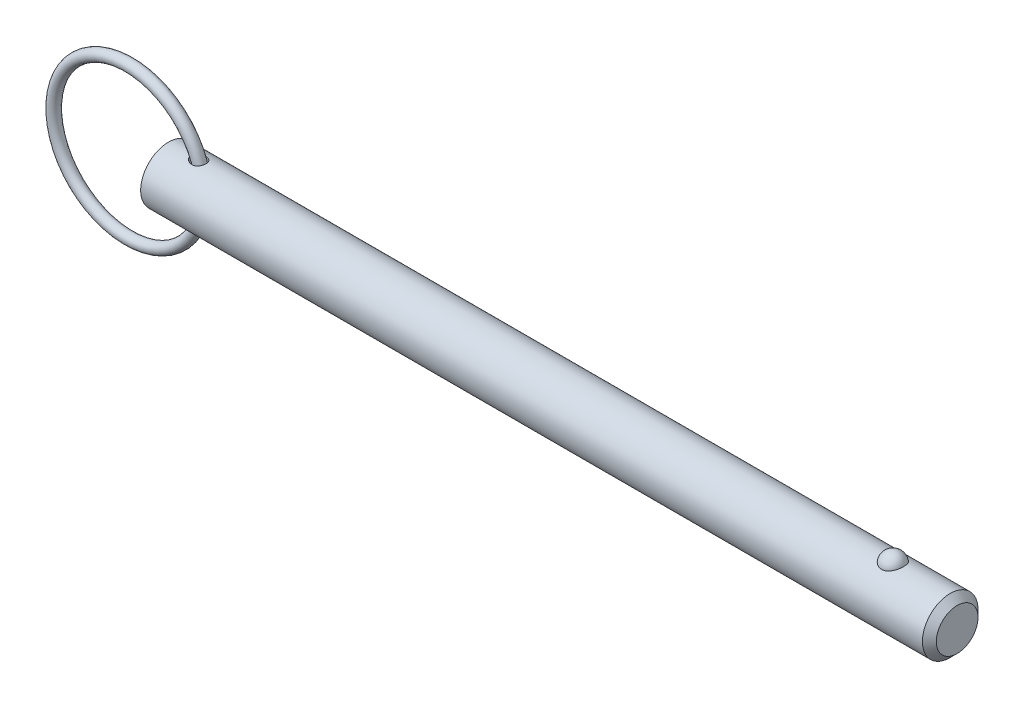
ISO-10303-21;
HEADER;
FILE_DESCRIPTION(('STEP AP214'),'2;1');
FILE_NAME('part.step','',(''),(''),'','','');
FILE_SCHEMA(('AUTOMOTIVE_DESIGN { 1 0 10303 214 1 1 1 1 }'));
ENDSEC;
DATA;
#1=APPLICATION_CONTEXT('core data for automotive mechanical design processes');
#2=APPLICATION_PROTOCOL_DEFINITION('international standard','automotive_design',2000,#1);
#3=PRODUCT_CONTEXT('',#1,'mechanical');
#4=PRODUCT('Part','Part','',(#3));
#5=PRODUCT_RELATED_PRODUCT_CATEGORY('part','',(#4));
#6=PRODUCT_DEFINITION_FORMATION('','',#4);
#7=PRODUCT_DEFINITION_CONTEXT('part definition',#1,'design');
#8=PRODUCT_DEFINITION('design','',#6,#7);
#9=PRODUCT_DEFINITION_SHAPE('','',#8);
#10=(LENGTH_UNIT() NAMED_UNIT(*) SI_UNIT(.MILLI.,.METRE.));
#11=(NAMED_UNIT(*) PLANE_ANGLE_UNIT() SI_UNIT($,.RADIAN.));
#12=(NAMED_UNIT(*) SI_UNIT($,.STERADIAN.) SOLID_ANGLE_UNIT());
#13=UNCERTAINTY_MEASURE_WITH_UNIT(LENGTH_MEASURE(1.E-05),#10,'distance_accuracy_value','');
#14=(GEOMETRIC_REPRESENTATION_CONTEXT(3) GLOBAL_UNCERTAINTY_ASSIGNED_CONTEXT((#13)) GLOBAL_UNIT_ASSIGNED_CONTEXT((#10,
#11,#12)) REPRESENTATION_CONTEXT('',''));
#15=CARTESIAN_POINT('',(0.,0.,0.));
#16=DIRECTION('',(0.,0.,1.));
#17=DIRECTION('',(1.,0.,0.));
#18=AXIS2_PLACEMENT_3D('',#15,#16,#17);
#19=CARTESIAN_POINT('',(-6.70471658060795,0.,0.));
#20=DIRECTION('',(0.,0.,1.));
#21=DIRECTION('',(1.,0.,0.));
#22=AXIS2_PLACEMENT_3D('',#19,#20,#21);
#23=TOROIDAL_SURFACE('',#22,12.7,0.940000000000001);
#24=CARTESIAN_POINT('',(6.93528341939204,0.,0.));
#25=VERTEX_POINT('',#24);
#26=VERTEX_LOOP('',#25);
#27=FACE_BOUND('',#26,.T.);
#28=ADVANCED_FACE('P0_F12',(#27),#23,.T.);
#29=CLOSED_SHELL('',(#28));
#30=MANIFOLD_SOLID_BREP('P0_B1',#29);
#31=CARTESIAN_POINT('',(0.,0.,0.));
#32=DIRECTION('',(1.,0.,0.));
#33=DIRECTION('',(0.,0.,-1.));
#34=AXIS2_PLACEMENT_3D('',#31,#32,#33);
#35=CYLINDRICAL_SURFACE('',#34,4.7);
#36=CARTESIAN_POINT('',(4.16378072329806,4.63584137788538,-0.773934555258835));
#37=CARTESIAN_POINT('',(4.22041228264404,4.62659903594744,-0.829297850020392));
#38=CARTESIAN_POINT('',(4.28206987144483,4.61719767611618,-0.87952289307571));
#39=CARTESIAN_POINT('',(4.41303152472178,4.59925351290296,-0.968997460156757));
#40=CARTESIAN_POINT('',(4.48234424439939,4.59071170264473,-1.00823437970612));
#41=CARTESIAN_POINT('',(4.62650734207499,4.5755493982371,-1.07495006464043));
#42=CARTESIAN_POINT('',(4.70135029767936,4.56892638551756,-1.10244426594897));
#43=CARTESIAN_POINT('',(4.85470490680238,4.55848940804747,-1.14483874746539));
#44=CARTESIAN_POINT('',(4.93321503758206,4.55467428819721,-1.15974420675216));
#45=CARTESIAN_POINT('',(5.09197970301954,4.55051176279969,-1.17597559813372));
#46=CARTESIAN_POINT('',(5.17223836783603,4.55017372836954,-1.17726483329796));
#47=CARTESIAN_POINT('',(5.33159446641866,4.55326696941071,-1.16524823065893));
#48=CARTESIAN_POINT('',(5.41069268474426,4.55669556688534,-1.15195276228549));
#49=CARTESIAN_POINT('',(5.55698758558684,4.56647801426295,-1.11249214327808));
#50=CARTESIAN_POINT('',(5.62458628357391,4.57250771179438,-1.08773548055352));
#51=CARTESIAN_POINT('',(5.7539770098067,4.58665356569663,-1.02644632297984));
#52=CARTESIAN_POINT('',(5.81577171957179,4.59476875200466,-0.989919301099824));
#53=CARTESIAN_POINT('',(5.92681484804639,4.61135052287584,-0.90939126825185));
#54=CARTESIAN_POINT('',(5.97666790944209,4.61973919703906,-0.866204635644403));
#55=CARTESIAN_POINT('',(6.06817854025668,4.63643253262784,-0.771868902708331));
#56=CARTESIAN_POINT('',(6.10983710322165,4.64473720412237,-0.720720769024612));
#57=CARTESIAN_POINT('',(6.18318089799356,4.660174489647,-0.612928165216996));
#58=CARTESIAN_POINT('',(6.21503150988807,4.66732544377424,-0.55639864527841));
#59=CARTESIAN_POINT('',(6.26900210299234,4.67985590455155,-0.438689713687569));
#60=CARTESIAN_POINT('',(6.29112194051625,4.68523538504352,-0.377510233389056));
#61=CARTESIAN_POINT('',(6.3252384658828,4.6936733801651,-0.251831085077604));
#62=CARTESIAN_POINT('',(6.33717189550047,4.69671737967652,-0.187313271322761));
#63=CARTESIAN_POINT('',(6.35042407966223,4.70010386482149,-0.0571258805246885));
#64=CARTESIAN_POINT('',(6.3517424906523,4.70044626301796,0.00854373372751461));
#65=CARTESIAN_POINT('',(6.34371729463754,4.69838816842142,0.139481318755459));
#66=CARTESIAN_POINT('',(6.33432596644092,4.69597539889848,0.204746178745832));
#67=CARTESIAN_POINT('',(6.30500866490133,4.68864655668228,0.332720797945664));
#68=CARTESIAN_POINT('',(6.28508259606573,4.68373046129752,0.395430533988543));
#69=CARTESIAN_POINT('',(6.23516511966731,4.67193431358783,0.516455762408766));
#70=CARTESIAN_POINT('',(6.20518126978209,4.66505573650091,0.574774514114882));
#71=CARTESIAN_POINT('',(6.1358631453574,4.65009270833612,0.685387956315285));
#72=CARTESIAN_POINT('',(6.09652950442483,4.64200833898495,0.737683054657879));
#73=CARTESIAN_POINT('',(6.00979078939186,4.62559001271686,0.834455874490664));
#74=CARTESIAN_POINT('',(5.96243625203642,4.61725787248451,0.878979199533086));
#75=CARTESIAN_POINT('',(5.86079843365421,4.60122574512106,0.959378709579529));
#76=CARTESIAN_POINT('',(5.80651591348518,4.59352568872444,0.995255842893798));
#77=CARTESIAN_POINT('',(5.69277386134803,4.57961669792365,1.05741527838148));
#78=CARTESIAN_POINT('',(5.63333134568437,4.57340309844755,1.08372773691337));
#79=CARTESIAN_POINT('',(5.5108424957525,4.56305640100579,1.12650026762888));
#80=CARTESIAN_POINT('',(5.44779577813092,4.55892352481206,1.14295928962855));
#81=CARTESIAN_POINT('',(5.3179566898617,4.55299444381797,1.1663590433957));
#82=CARTESIAN_POINT('',(5.25110869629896,4.55127026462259,1.17300670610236));
#83=CARTESIAN_POINT('',(5.11716812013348,4.55043953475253,1.17622268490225));
#84=CARTESIAN_POINT('',(5.05007546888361,4.55133378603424,1.17278791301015));
#85=CARTESIAN_POINT('',(4.91166083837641,4.55569951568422,1.15571913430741));
#86=CARTESIAN_POINT('',(4.84044690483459,4.55937764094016,1.1412666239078));
#87=CARTESIAN_POINT('',(4.70108819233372,4.56903562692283,1.10196123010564));
#88=CARTESIAN_POINT('',(4.63294574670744,4.57501720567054,1.07710058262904));
#89=CARTESIAN_POINT('',(4.4947730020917,4.58927184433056,1.01474439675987));
#90=CARTESIAN_POINT('',(4.42520748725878,4.59771156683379,0.976252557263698));
#91=CARTESIAN_POINT('',(4.29354165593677,4.61552030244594,0.888246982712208));
#92=CARTESIAN_POINT('',(4.23143936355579,4.62488906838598,0.838736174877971));
#93=CARTESIAN_POINT('',(4.12609666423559,4.64192969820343,0.738015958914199));
#94=CARTESIAN_POINT('',(4.08142630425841,4.64963595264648,0.68830869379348));
#95=CARTESIAN_POINT('',(4.0008117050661,4.66411457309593,0.582144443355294));
#96=CARTESIAN_POINT('',(3.96485623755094,4.6708881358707,0.525696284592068));
#97=CARTESIAN_POINT('',(3.90818393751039,4.68183565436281,0.415917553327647));
#98=CARTESIAN_POINT('',(3.88599581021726,4.68624644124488,0.363372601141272));
#99=CARTESIAN_POINT('',(3.85055971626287,4.693376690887,0.255230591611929));
#100=CARTESIAN_POINT('',(3.83730635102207,4.69609717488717,0.199635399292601));
#101=CARTESIAN_POINT('',(3.82058225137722,4.69954043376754,0.0867104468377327));
#102=CARTESIAN_POINT('',(3.81714632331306,4.70025610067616,0.0293752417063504));
#103=CARTESIAN_POINT('',(3.8204140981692,4.69957935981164,-0.0849928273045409));
#104=CARTESIAN_POINT('',(3.82711802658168,4.69818690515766,-0.14202568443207));
#105=CARTESIAN_POINT('',(3.84950128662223,4.69360426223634,-0.250744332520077));
#106=CARTESIAN_POINT('',(3.8646389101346,4.69052274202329,-0.302548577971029));
#107=CARTESIAN_POINT('',(3.90261190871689,4.68295207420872,-0.403121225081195));
#108=CARTESIAN_POINT('',(3.92544863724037,4.67846267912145,-0.451889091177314));
#109=CARTESIAN_POINT('',(3.97999306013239,4.6680441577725,-0.549522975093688));
#110=CARTESIAN_POINT('',(4.01228648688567,4.66202553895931,-0.598050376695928));
#111=CARTESIAN_POINT('',(4.08340845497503,4.64931397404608,-0.689954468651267));
#112=CARTESIAN_POINT('',(4.12224260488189,4.64262045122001,-0.733326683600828));
#113=CARTESIAN_POINT('',(4.16378072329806,4.63584137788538,-0.773934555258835));
#114=B_SPLINE_CURVE_WITH_KNOTS('',3,(#36,#37,#38,#39,#40,#41,#42,#43,#44,#45,#46,#47,#48,#49,
#50,#51,#52,#53,#54,#55,#56,#57,#58,#59,#60,#61,#62,#63,#64,#65,#66,#67,#68,#69,#70,#71,#72,#73,
#74,#75,#76,#77,#78,#79,#80,#81,#82,#83,#84,#85,#86,#87,#88,#89,#90,#91,#92,#93,#94,#95,#96,#97,
#98,#99,#100,#101,#102,#103,#104,#105,#106,#107,#108,#109,#110,#111,#112,#113),.UNSPECIFIED.,
.T.,.F.,(4,2,2,2,2,2,2,2,2,2,2,2,2,2,2,2,2,2,2,2,2,2,2,2,2,2,2,2,2,2,2,2,2,2,2,2,2,2,4),(0.,
0.238977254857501,0.478227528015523,0.717162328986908,0.955998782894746,1.19547875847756,
1.43478857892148,1.65034375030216,1.8657988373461,2.06429861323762,2.26277430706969,
2.45769248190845,2.65261353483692,2.848736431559,3.04486567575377,3.24187227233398,
3.43888065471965,3.6357413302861,3.83258866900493,4.02823898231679,4.22386782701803,
4.41887441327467,4.61390177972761,4.81464443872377,5.0154485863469,5.2328283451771,
5.45037055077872,5.68914354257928,5.92785317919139,6.12887730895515,6.32964104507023,
6.50053592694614,6.67132745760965,6.84272375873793,7.0141238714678,7.17560768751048,
7.33711990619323,7.5122540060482,7.68753905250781),.UNSPECIFIED.);
#115=CARTESIAN_POINT('',(4.16378072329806,4.63584137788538,-0.773934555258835));
#116=VERTEX_POINT('',#115);
#117=EDGE_CURVE('P1_E40',#116,#116,#114,.T.);
#118=ORIENTED_EDGE('',*,*,#117,.T.);
#119=EDGE_LOOP('',(#118));
#120=FACE_BOUND('',#119,.T.);
#121=CARTESIAN_POINT('',(132.175,0.,0.));
#122=DIRECTION('',(1.,0.,0.));
#123=DIRECTION('',(0.,0.,-1.));
#124=AXIS2_PLACEMENT_3D('',#121,#122,#123);
#125=CIRCLE('',#124,4.7);
#126=CARTESIAN_POINT('',(132.175,0.,-4.7));
#127=VERTEX_POINT('',#126);
#128=EDGE_CURVE('P1_E25',#127,#127,#125,.T.);
#129=ORIENTED_EDGE('',*,*,#128,.F.);
#130=EDGE_LOOP('',(#129));
#131=FACE_BOUND('',#130,.T.);
#132=CARTESIAN_POINT('',(0.,0.,0.));
#133=DIRECTION('',(1.,0.,0.));
#134=DIRECTION('',(0.,0.,-1.));
#135=AXIS2_PLACEMENT_3D('',#132,#133,#134);
#136=CIRCLE('',#135,4.7);
#137=CARTESIAN_POINT('',(0.,0.,-4.7));
#138=VERTEX_POINT('',#137);
#139=EDGE_CURVE('P1_E9',#138,#138,#136,.T.);
#140=ORIENTED_EDGE('',*,*,#139,.T.);
#141=EDGE_LOOP('',(#140));
#142=FACE_BOUND('',#141,.T.);
#143=CARTESIAN_POINT('',(122.48062830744,4.30387706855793,1.88855557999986));
#144=CARTESIAN_POINT('',(122.382813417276,4.30388592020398,1.88854684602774));
#145=CARTESIAN_POINT('',(122.284851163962,4.30731231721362,1.88078712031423));
#146=CARTESIAN_POINT('',(122.091662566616,4.32065009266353,1.84993192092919));
#147=CARTESIAN_POINT('',(121.996443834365,4.33057798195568,1.8267974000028));
#148=CARTESIAN_POINT('',(121.81181755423,4.35574577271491,1.76594245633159));
#149=CARTESIAN_POINT('',(121.722395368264,4.370971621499,1.72826059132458));
#150=CARTESIAN_POINT('',(121.551390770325,4.40507782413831,1.63937301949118));
#151=CARTESIAN_POINT('',(121.469805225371,4.42395670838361,1.58817274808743));
#152=CARTESIAN_POINT('',(121.313901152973,4.46404088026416,1.47181116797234));
#153=CARTESIAN_POINT('',(121.239875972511,4.48529915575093,1.40627540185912));
#154=CARTESIAN_POINT('',(121.103536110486,4.527485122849,1.26387806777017));
#155=CARTESIAN_POINT('',(121.041224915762,4.54841271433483,1.18701313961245));
#156=CARTESIAN_POINT('',(120.927072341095,4.58876216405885,1.02025841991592));
#157=CARTESIAN_POINT('',(120.875811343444,4.60807744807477,0.929944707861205));
#158=CARTESIAN_POINT('',(120.78842456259,4.6421320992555,0.741468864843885));
#159=CARTESIAN_POINT('',(120.752299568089,4.65687122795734,0.643306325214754));
#160=CARTESIAN_POINT('',(120.695671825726,4.68038485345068,0.440967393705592));
#161=CARTESIAN_POINT('',(120.675304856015,4.68910744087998,0.33674687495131));
#162=CARTESIAN_POINT('',(120.651132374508,4.69949255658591,0.126059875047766));
#163=CARTESIAN_POINT('',(120.647326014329,4.70115544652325,0.0195935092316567));
#164=CARTESIAN_POINT('',(120.656308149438,4.69727256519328,-0.191500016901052));
#165=CARTESIAN_POINT('',(120.668941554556,4.69179416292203,-0.296135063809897));
#166=CARTESIAN_POINT('',(120.710276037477,4.67429351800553,-0.501612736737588));
#167=CARTESIAN_POINT('',(120.738977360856,4.66227117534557,-0.602455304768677));
#168=CARTESIAN_POINT('',(120.811928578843,4.63286427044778,-0.797707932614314));
#169=CARTESIAN_POINT('',(120.856204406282,4.61547077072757,-0.89210694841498));
#170=CARTESIAN_POINT('',(120.959407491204,4.5770990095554,-1.07173134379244));
#171=CARTESIAN_POINT('',(121.018336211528,4.55612039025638,-1.15695580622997));
#172=CARTESIAN_POINT('',(121.150216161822,4.51257918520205,-1.31664252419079));
#173=CARTESIAN_POINT('',(121.223286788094,4.49000423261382,-1.39100294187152));
#174=CARTESIAN_POINT('',(121.381478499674,4.44594443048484,-1.52598548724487));
#175=CARTESIAN_POINT('',(121.466599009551,4.42445952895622,-1.58660827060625));
#176=CARTESIAN_POINT('',(121.645267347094,4.38543655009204,-1.69145998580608));
#177=CARTESIAN_POINT('',(121.738651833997,4.36783887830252,-1.73594433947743));
#178=CARTESIAN_POINT('',(121.93242205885,4.3382941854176,-1.80852276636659));
#179=CARTESIAN_POINT('',(122.032805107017,4.32634500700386,-1.83662309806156));
#180=CARTESIAN_POINT('',(122.23228752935,4.31005085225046,-1.87453136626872));
#181=CARTESIAN_POINT('',(122.331196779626,4.30535309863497,-1.88518956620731));
#182=CARTESIAN_POINT('',(122.529521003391,4.30299844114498,-1.89055986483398));
#183=CARTESIAN_POINT('',(122.628935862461,4.30534000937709,-1.8852754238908));
#184=CARTESIAN_POINT('',(122.82186386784,4.31657737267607,-1.85939299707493));
#185=CARTESIAN_POINT('',(122.915462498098,4.32524571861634,-1.83932621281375));
#186=CARTESIAN_POINT('',(123.097783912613,4.34791518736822,-1.78507441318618));
#187=CARTESIAN_POINT('',(123.186506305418,4.36191673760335,-1.75088826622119));
#188=CARTESIAN_POINT('',(123.358694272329,4.39411605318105,-1.66845234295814));
#189=CARTESIAN_POINT('',(123.442008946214,4.41239631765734,-1.61992036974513));
#190=CARTESIAN_POINT('',(123.599399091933,4.4510924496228,-1.51034589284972));
#191=CARTESIAN_POINT('',(123.673472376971,4.47150882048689,-1.44930043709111));
#192=CARTESIAN_POINT('',(123.814405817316,4.51353865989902,-1.31275193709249));
#193=CARTESIAN_POINT('',(123.880701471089,4.53515983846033,-1.23666813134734));
#194=CARTESIAN_POINT('',(124.000069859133,4.57635116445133,-1.07425533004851));
#195=CARTESIAN_POINT('',(124.05314024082,4.5959209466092,-0.987924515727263));
#196=CARTESIAN_POINT('',(124.146443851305,4.63161819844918,-0.804428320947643));
#197=CARTESIAN_POINT('',(124.186229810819,4.64762063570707,-0.707010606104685));
#198=CARTESIAN_POINT('',(124.249825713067,4.6737403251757,-0.506344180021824));
#199=CARTESIAN_POINT('',(124.273635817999,4.68385763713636,-0.403095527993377));
#200=CARTESIAN_POINT('',(124.304751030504,4.69716075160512,-0.193975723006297));
#201=CARTESIAN_POINT('',(124.312098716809,4.70036443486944,-0.088112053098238));
#202=CARTESIAN_POINT('',(124.310261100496,4.6995691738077,0.123441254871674));
#203=CARTESIAN_POINT('',(124.301076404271,4.69557049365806,0.229130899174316));
#204=CARTESIAN_POINT('',(124.266492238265,4.68082941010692,0.436545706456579));
#205=CARTESIAN_POINT('',(124.241209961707,4.67013575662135,0.538293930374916));
#206=CARTESIAN_POINT('',(124.175050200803,4.64311776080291,0.735797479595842));
#207=CARTESIAN_POINT('',(124.134171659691,4.62679303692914,0.831552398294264));
#208=CARTESIAN_POINT('',(124.037286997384,4.5900271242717,1.01512750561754));
#209=CARTESIAN_POINT('',(123.981173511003,4.56955699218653,1.10288523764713));
#210=CARTESIAN_POINT('',(123.85510852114,4.52671789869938,1.26730106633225));
#211=CARTESIAN_POINT('',(123.785157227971,4.50434896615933,1.3439593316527));
#212=CARTESIAN_POINT('',(123.632724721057,4.46008413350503,1.48428028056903));
#213=CARTESIAN_POINT('',(123.550209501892,4.43818970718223,1.54790656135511));
#214=CARTESIAN_POINT('',(123.374735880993,4.39746476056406,1.66008504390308));
#215=CARTESIAN_POINT('',(123.281773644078,4.37863537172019,1.70863168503));
#216=CARTESIAN_POINT('',(123.091099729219,4.34688784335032,1.78783023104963));
#217=CARTESIAN_POINT('',(122.993629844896,4.33380220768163,1.81899757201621));
#218=CARTESIAN_POINT('',(122.794405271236,4.3143515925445,1.86467392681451));
#219=CARTESIAN_POINT('',(122.692663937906,4.30796708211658,1.87923136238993));
#220=CARTESIAN_POINT('',(122.55391360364,4.3043503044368,1.88747378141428));
#221=CARTESIAN_POINT('',(122.51728130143,4.30387375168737,1.88855885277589));
#222=CARTESIAN_POINT('',(122.48062830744,4.30387706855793,1.88855557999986));
#223=B_SPLINE_CURVE_WITH_KNOTS('',3,(#143,#144,#145,#146,#147,#148,#149,#150,#151,#152,#153,
#154,#155,#156,#157,#158,#159,#160,#161,#162,#163,#164,#165,#166,#167,#168,#169,#170,#171,#172,
#173,#174,#175,#176,#177,#178,#179,#180,#181,#182,#183,#184,#185,#186,#187,#188,#189,#190,#191,
#192,#193,#194,#195,#196,#197,#198,#199,#200,#201,#202,#203,#204,#205,#206,#207,#208,#209,#210,
#211,#212,#213,#214,#215,#216,#217,#218,#219,#220,#221,#222),.UNSPECIFIED.,.T.,.F.,(4,2,2,2,2,2,
2,2,2,2,2,2,2,2,2,2,2,2,2,2,2,2,2,2,2,2,2,2,2,2,2,2,2,2,2,2,2,2,2,4),(0.,0.29333979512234,
0.587427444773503,0.880740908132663,1.17393661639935,1.47597417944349,1.77810150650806,
2.09350493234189,2.40892479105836,2.72703308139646,3.0451250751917,3.36023788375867,
3.6753555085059,3.99100033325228,4.30667668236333,4.62514463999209,4.94359739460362,
5.25676407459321,5.56981105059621,5.86708641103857,6.16429725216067,6.45131888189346,
6.73836351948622,7.03148013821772,7.32466598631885,7.63288296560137,7.94115473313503,
8.25895074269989,8.57674352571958,8.89371340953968,9.21067166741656,9.52534839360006,
9.84004644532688,10.157022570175,10.4739938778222,10.7918388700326,11.1098009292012,
11.4177488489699,11.7247967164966,11.8347163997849),.UNSPECIFIED.);
#224=CARTESIAN_POINT('',(122.48062830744,4.30387706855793,1.88855557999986));
#225=VERTEX_POINT('',#224);
#226=EDGE_CURVE('P1_E34',#225,#225,#223,.T.);
#227=ORIENTED_EDGE('',*,*,#226,.T.);
#228=EDGE_LOOP('',(#227));
#229=FACE_BOUND('',#228,.T.);
#230=CARTESIAN_POINT('',(4.16378072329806,-4.63584137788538,-0.773934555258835));
#231=CARTESIAN_POINT('',(4.11797605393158,-4.64331682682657,-0.729154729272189));
#232=CARTESIAN_POINT('',(4.07545237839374,-4.65068929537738,-0.681007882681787));
#233=CARTESIAN_POINT('',(3.99850919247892,-4.66454993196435,-0.578483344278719));
#234=CARTESIAN_POINT('',(3.96408464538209,-4.67103864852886,-0.524109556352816));
#235=CARTESIAN_POINT('',(3.90486465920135,-4.68247538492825,-0.409579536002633));
#236=CARTESIAN_POINT('',(3.88014787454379,-4.68741075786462,-0.349380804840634));
#237=CARTESIAN_POINT('',(3.84254060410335,-4.69500854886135,-0.225256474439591));
#238=CARTESIAN_POINT('',(3.82963753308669,-4.69767338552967,-0.161334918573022));
#239=CARTESIAN_POINT('',(3.81750619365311,-4.70018000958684,-0.0396774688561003));
#240=CARTESIAN_POINT('',(3.8168623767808,-4.70031401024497,0.0179134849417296));
#241=CARTESIAN_POINT('',(3.82570055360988,-4.69848615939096,0.132270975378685));
#242=CARTESIAN_POINT('',(3.83518142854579,-4.6965245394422,0.189037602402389));
#243=CARTESIAN_POINT('',(3.8627670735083,-4.69091189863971,0.296808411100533));
#244=CARTESIAN_POINT('',(3.88034293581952,-4.68736483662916,0.347956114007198));
#245=CARTESIAN_POINT('',(3.92293217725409,-4.67896699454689,0.446919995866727));
#246=CARTESIAN_POINT('',(3.94794743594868,-4.67411588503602,0.494735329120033));
#247=CARTESIAN_POINT('',(4.00723361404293,-4.66297432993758,0.590975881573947));
#248=CARTESIAN_POINT('',(4.04218787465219,-4.65658759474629,0.63896688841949));
#249=CARTESIAN_POINT('',(4.11850165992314,-4.64327412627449,0.729452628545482));
#250=CARTESIAN_POINT('',(4.15986486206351,-4.63634708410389,0.771944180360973));
#251=CARTESIAN_POINT('',(4.25563139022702,-4.62124878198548,0.858077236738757));
#252=CARTESIAN_POINT('',(4.3110472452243,-4.61307408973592,0.900593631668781));
#253=CARTESIAN_POINT('',(4.42760239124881,-4.59748077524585,0.977085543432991));
#254=CARTESIAN_POINT('',(4.48874590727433,-4.59006271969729,1.01105468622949));
#255=CARTESIAN_POINT('',(4.62409915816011,-4.5757760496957,1.07399161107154));
#256=CARTESIAN_POINT('',(4.69895162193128,-4.56912175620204,1.10163764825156));
#257=CARTESIAN_POINT('',(4.85238616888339,-4.55861611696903,1.14433682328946));
#258=CARTESIAN_POINT('',(4.93096882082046,-4.55476520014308,1.15938803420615));
#259=CARTESIAN_POINT('',(5.08983848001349,-4.55053674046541,1.17587995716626));
#260=CARTESIAN_POINT('',(5.17012835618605,-4.55016559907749,1.17729558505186));
#261=CARTESIAN_POINT('',(5.32956049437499,-4.55319561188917,1.16552635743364));
#262=CARTESIAN_POINT('',(5.40870366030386,-4.55659361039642,1.15235371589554));
#263=CARTESIAN_POINT('',(5.55512154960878,-4.56632591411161,1.11311448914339));
#264=CARTESIAN_POINT('',(5.62279525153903,-4.57233592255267,1.08845479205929));
#265=CARTESIAN_POINT('',(5.75235194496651,-4.58645252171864,1.02734156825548));
#266=CARTESIAN_POINT('',(5.81423750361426,-4.59455817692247,0.990893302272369));
#267=CARTESIAN_POINT('',(5.92544729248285,-4.61112960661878,0.910507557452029));
#268=CARTESIAN_POINT('',(5.9753775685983,-4.61951638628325,0.867388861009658));
#269=CARTESIAN_POINT('',(6.06705041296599,-4.63621447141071,0.773173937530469));
#270=CARTESIAN_POINT('',(6.10879399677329,-4.64452578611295,0.722078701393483));
#271=CARTESIAN_POINT('',(6.18230323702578,-4.65998194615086,0.614385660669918));
#272=CARTESIAN_POINT('',(6.21423602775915,-4.66714520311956,0.557904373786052));
#273=CARTESIAN_POINT('',(6.26837651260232,-4.67970630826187,0.440277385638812));
#274=CARTESIAN_POINT('',(6.29058407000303,-4.68510413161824,0.379131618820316));
#275=CARTESIAN_POINT('',(6.32487950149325,-4.69358284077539,0.253506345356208));
#276=CARTESIAN_POINT('',(6.33690441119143,-4.69664929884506,0.189008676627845));
#277=CARTESIAN_POINT('',(6.35034148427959,-4.70008248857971,0.05884554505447));
#278=CARTESIAN_POINT('',(6.35175330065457,-4.70044913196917,-0.00681995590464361));
#279=CARTESIAN_POINT('',(6.34391515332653,-4.69843881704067,-0.137767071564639));
#280=CARTESIAN_POINT('',(6.33461722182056,-4.69604951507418,-0.203045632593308));
#281=CARTESIAN_POINT('',(6.30548404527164,-4.68876413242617,-0.331063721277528));
#282=CARTESIAN_POINT('',(6.28564870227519,-4.68386802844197,-0.393803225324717));
#283=CARTESIAN_POINT('',(6.23590713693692,-4.67210599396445,-0.514904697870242));
#284=CARTESIAN_POINT('',(6.20600824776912,-4.66524149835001,-0.573269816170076));
#285=CARTESIAN_POINT('',(6.13685224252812,-4.65029918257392,-0.683989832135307));
#286=CARTESIAN_POINT('',(6.09759575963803,-4.6422214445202,-0.736345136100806));
#287=CARTESIAN_POINT('',(6.01099960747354,-4.62580793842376,-0.833250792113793));
#288=CARTESIAN_POINT('',(5.963710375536,-4.61747403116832,-0.877846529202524));
#289=CARTESIAN_POINT('',(5.8621900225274,-4.60143050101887,-0.958399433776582));
#290=CARTESIAN_POINT('',(5.80795966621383,-4.59372080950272,-0.99435755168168));
#291=CARTESIAN_POINT('',(5.69431062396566,-4.57978661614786,-1.05668157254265));
#292=CARTESIAN_POINT('',(5.63490936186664,-4.57355737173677,-1.08307825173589));
#293=CARTESIAN_POINT('',(5.51248756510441,-4.56317492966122,-1.12602176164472));
#294=CARTESIAN_POINT('',(5.44946662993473,-4.55902196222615,-1.1425675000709));
#295=CARTESIAN_POINT('',(5.31967752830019,-4.55305083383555,-1.16613984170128));
#296=CARTESIAN_POINT('',(5.25285368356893,-4.55130415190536,-1.17287534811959));
#297=CARTESIAN_POINT('',(5.11894995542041,-4.55042807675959,-1.17626714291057));
#298=CARTESIAN_POINT('',(5.05187000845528,-4.55129938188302,-1.17292074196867));
#299=CARTESIAN_POINT('',(4.91348721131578,-4.55561850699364,-1.15603764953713));
#300=CARTESIAN_POINT('',(4.84229084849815,-4.55927235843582,-1.14168541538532));
#301=CARTESIAN_POINT('',(4.70293860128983,-4.56888540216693,-1.10258192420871));
#302=CARTESIAN_POINT('',(4.63478566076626,-4.57484677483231,-1.07782082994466));
#303=CARTESIAN_POINT('',(4.49401200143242,-4.58932889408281,-1.01452290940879));
#304=CARTESIAN_POINT('',(4.42204931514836,-4.59808779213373,-0.974568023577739));
#305=CARTESIAN_POINT('',(4.28620227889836,-4.61656806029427,-0.882881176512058));
#306=CARTESIAN_POINT('',(4.22231268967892,-4.62628879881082,-0.831156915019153));
#307=CARTESIAN_POINT('',(4.16378072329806,-4.63584137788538,-0.773934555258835));
#308=B_SPLINE_CURVE_WITH_KNOTS('',3,(#230,#231,#232,#233,#234,#235,#236,#237,#238,#239,#240,
#241,#242,#243,#244,#245,#246,#247,#248,#249,#250,#251,#252,#253,#254,#255,#256,#257,#258,#259,
#260,#261,#262,#263,#264,#265,#266,#267,#268,#269,#270,#271,#272,#273,#274,#275,#276,#277,#278,
#279,#280,#281,#282,#283,#284,#285,#286,#287,#288,#289,#290,#291,#292,#293,#294,#295,#296,#297,
#298,#299,#300,#301,#302,#303,#304,#305,#306,#307),.UNSPECIFIED.,.T.,.F.,(4,2,2,2,2,2,2,2,2,2,2,
2,2,2,2,2,2,2,2,2,2,2,2,2,2,2,2,2,2,2,2,2,2,2,2,2,2,2,4),(0.,0.193263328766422,
0.386406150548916,0.581083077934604,0.775552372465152,0.947410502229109,1.11924964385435,
1.28117818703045,1.44314767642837,1.62161944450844,1.80019400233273,2.01034324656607,
2.22064874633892,2.45975127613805,2.69889038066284,2.93846932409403,3.1778478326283,
3.39350806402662,3.6090721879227,3.8076122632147,4.00612769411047,4.20104508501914,
4.39596521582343,4.59208201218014,4.78820522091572,4.98521027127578,5.18221715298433,
5.37908078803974,5.57593110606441,5.7715882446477,5.96722384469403,6.1622240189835,
6.35724581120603,6.55794420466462,6.75869613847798,6.97596054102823,7.1934307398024,
7.44055547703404,7.68751900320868),.UNSPECIFIED.);
#309=CARTESIAN_POINT('',(4.16378072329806,-4.63584137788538,-0.773934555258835));
#310=VERTEX_POINT('',#309);
#311=EDGE_CURVE('P1_E17',#310,#310,#308,.T.);
#312=ORIENTED_EDGE('',*,*,#311,.T.);
#313=EDGE_LOOP('',(#312));
#314=FACE_BOUND('',#313,.T.);
#315=ADVANCED_FACE('P1_F13',(#120,#131,#142,#229,#314),#35,.T.);
#316=CARTESIAN_POINT('',(0.,0.,0.));
#317=DIRECTION('',(-1.,0.,0.));
#318=DIRECTION('',(0.,0.,1.));
#319=AXIS2_PLACEMENT_3D('',#316,#317,#318);
#320=PLANE('',#319);
#321=ORIENTED_EDGE('',*,*,#139,.F.);
#322=EDGE_LOOP('',(#321));
#323=FACE_BOUND('',#322,.T.);
#324=ADVANCED_FACE('P1_F15',(#323),#320,.T.);
#325=CARTESIAN_POINT('',(133.35,0.,0.));
#326=DIRECTION('',(-1.,0.,0.));
#327=DIRECTION('',(0.,0.,1.));
#328=AXIS2_PLACEMENT_3D('',#325,#326,#327);
#329=CONICAL_SURFACE('',#328,3.52500000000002,0.785398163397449);
#330=ORIENTED_EDGE('',*,*,#128,.T.);
#331=EDGE_LOOP('',(#330));
#332=FACE_BOUND('',#331,.T.);
#333=CARTESIAN_POINT('',(133.35,0.,0.));
#334=DIRECTION('',(1.,0.,0.));
#335=DIRECTION('',(0.,0.,-1.));
#336=AXIS2_PLACEMENT_3D('',#333,#334,#335);
#337=CIRCLE('',#336,3.52500000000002);
#338=CARTESIAN_POINT('',(133.35,0.,-3.52500000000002));
#339=VERTEX_POINT('',#338);
#340=EDGE_CURVE('P1_E30',#339,#339,#337,.T.);
#341=ORIENTED_EDGE('',*,*,#340,.F.);
#342=EDGE_LOOP('',(#341));
#343=FACE_BOUND('',#342,.T.);
#344=ADVANCED_FACE('P1_F55',(#332,#343),#329,.T.);
#345=CARTESIAN_POINT('',(133.35,3.52500000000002,0.));
#346=DIRECTION('',(1.,0.,0.));
#347=DIRECTION('',(0.,0.,-1.));
#348=AXIS2_PLACEMENT_3D('',#345,#346,#347);
#349=PLANE('',#348);
#350=ORIENTED_EDGE('',*,*,#340,.T.);
#351=EDGE_LOOP('',(#350));
#352=FACE_BOUND('',#351,.T.);
#353=ADVANCED_FACE('P1_F51',(#352),#349,.T.);
#354=CARTESIAN_POINT('',(122.48062830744,4.23,0.));
#355=DIRECTION('',(-1.,0.,0.));
#356=DIRECTION('',(0.,1.,0.));
#357=AXIS2_PLACEMENT_3D('',#354,#355,#356);
#358=SPHERICAL_SURFACE('',#357,1.88999999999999);
#359=ORIENTED_EDGE('',*,*,#226,.F.);
#360=EDGE_LOOP('',(#359));
#361=FACE_BOUND('',#360,.T.);
#362=ADVANCED_FACE('P1_F46',(#361),#358,.T.);
#363=CARTESIAN_POINT('',(-6.70471658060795,0.,0.));
#364=DIRECTION('',(0.,0.,1.));
#365=DIRECTION('',(1.,0.,0.));
#366=AXIS2_PLACEMENT_3D('',#363,#364,#365);
#367=TOROIDAL_SURFACE('',#366,12.7,1.175);
#368=ORIENTED_EDGE('',*,*,#311,.F.);
#369=EDGE_LOOP('',(#368));
#370=FACE_BOUND('',#369,.T.);
#371=ORIENTED_EDGE('',*,*,#117,.F.);
#372=EDGE_LOOP('',(#371));
#373=FACE_BOUND('',#372,.T.);
#374=ADVANCED_FACE('P1_F50',(#370,#373),#367,.F.);
#375=CLOSED_SHELL('',(#315,#324,#344,#353,#362,#374));
#376=MANIFOLD_SOLID_BREP('P1_B1',#375);
#377=ADVANCED_BREP_SHAPE_REPRESENTATION('',(#18,#30,#376),#14);
#378=SHAPE_DEFINITION_REPRESENTATION(#9,#377);
ENDSEC;
END-ISO-10303-21;
